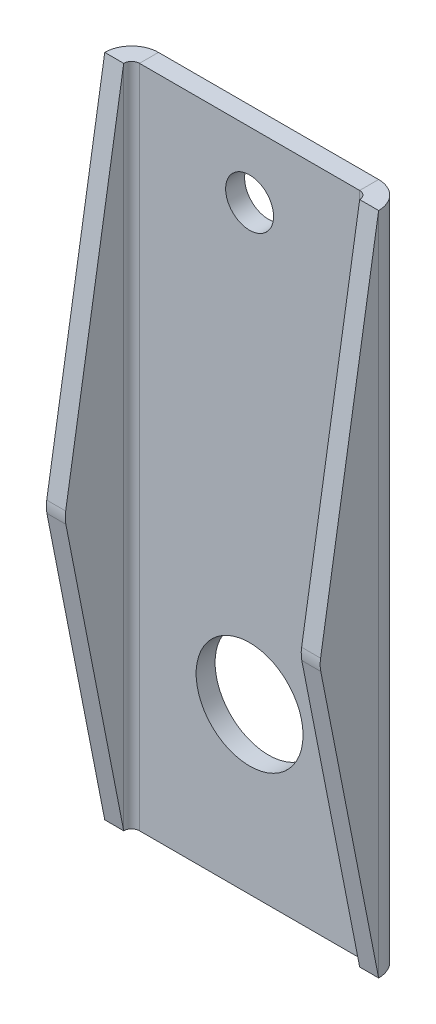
ISO-10303-21;
HEADER;
FILE_DESCRIPTION(('STEP AP214'),'2;1');
FILE_NAME('part.step','',(''),(''),'','','');
FILE_SCHEMA(('AUTOMOTIVE_DESIGN { 1 0 10303 214 1 1 1 1 }'));
ENDSEC;
DATA;
#1=APPLICATION_CONTEXT('core data for automotive mechanical design processes');
#2=APPLICATION_PROTOCOL_DEFINITION('international standard','automotive_design',2000,#1);
#3=PRODUCT_CONTEXT('',#1,'mechanical');
#4=PRODUCT('Part','Part','',(#3));
#5=PRODUCT_RELATED_PRODUCT_CATEGORY('part','',(#4));
#6=PRODUCT_DEFINITION_FORMATION('','',#4);
#7=PRODUCT_DEFINITION_CONTEXT('part definition',#1,'design');
#8=PRODUCT_DEFINITION('design','',#6,#7);
#9=PRODUCT_DEFINITION_SHAPE('','',#8);
#10=(LENGTH_UNIT() NAMED_UNIT(*) SI_UNIT(.MILLI.,.METRE.));
#11=(NAMED_UNIT(*) PLANE_ANGLE_UNIT() SI_UNIT($,.RADIAN.));
#12=(NAMED_UNIT(*) SI_UNIT($,.STERADIAN.) SOLID_ANGLE_UNIT());
#13=UNCERTAINTY_MEASURE_WITH_UNIT(LENGTH_MEASURE(1.E-05),#10,'distance_accuracy_value','');
#14=(GEOMETRIC_REPRESENTATION_CONTEXT(3) GLOBAL_UNCERTAINTY_ASSIGNED_CONTEXT((#13)) GLOBAL_UNIT_ASSIGNED_CONTEXT((#10,
#11,#12)) REPRESENTATION_CONTEXT('',''));
#15=CARTESIAN_POINT('',(0.,0.,0.));
#16=DIRECTION('',(0.,0.,1.));
#17=DIRECTION('',(1.,0.,0.));
#18=AXIS2_PLACEMENT_3D('',#15,#16,#17);
#19=CARTESIAN_POINT('',(-6.60400000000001,0.,0.));
#20=DIRECTION('',(1.,0.,0.));
#21=DIRECTION('',(0.,0.,-1.));
#22=AXIS2_PLACEMENT_3D('',#19,#20,#21);
#23=PLANE('',#22);
#24=DIRECTION('',(0.,0.981237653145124,0.192802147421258));
#25=VECTOR('',#24,1.);
#26=CARTESIAN_POINT('',(-6.60400000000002,-0.667860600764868,3.39897650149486));
#27=LINE('',#26,#25);
#28=CARTESIAN_POINT('',(-6.604,-16.0274,0.380999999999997));
#29=VERTEX_POINT('',#28);
#30=CARTESIAN_POINT('',(-6.60400000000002,-1.83007340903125,3.17061477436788));
#31=VERTEX_POINT('',#30);
#32=EDGE_CURVE('E181',#29,#31,#27,.T.);
#33=ORIENTED_EDGE('',*,*,#32,.T.);
#34=CARTESIAN_POINT('',(-6.60400000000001,-1.52400000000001,1.61289999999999));
#35=DIRECTION('',(1.,0.,0.));
#36=DIRECTION('',(0.,0.,-1.));
#37=AXIS2_PLACEMENT_3D('',#34,#35,#36);
#38=CIRCLE('',#37,1.5875);
#39=CARTESIAN_POINT('',(-6.60400000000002,-1.27041984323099,3.18001625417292));
#40=VERTEX_POINT('',#39);
#41=EDGE_CURVE('E168',#31,#40,#38,.F.);
#42=ORIENTED_EDGE('',*,*,#41,.T.);
#43=DIRECTION('',(0.,0.987159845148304,-0.159735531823));
#44=VECTOR('',#43,1.);
#45=CARTESIAN_POINT('',(-6.60400000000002,0.469023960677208,2.89855121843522));
#46=LINE('',#45,#44);
#47=CARTESIAN_POINT('',(-6.60400000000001,16.0274,0.38099999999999));
#48=VERTEX_POINT('',#47);
#49=EDGE_CURVE('E176',#40,#48,#46,.T.);
#50=ORIENTED_EDGE('',*,*,#49,.T.);
#51=DIRECTION('',(0.,-1.,0.));
#52=VECTOR('',#51,1.);
#53=CARTESIAN_POINT('',(-6.60400000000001,16.0274,0.380999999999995));
#54=LINE('',#53,#52);
#55=EDGE_CURVE('E188',#29,#48,#54,.F.);
#56=ORIENTED_EDGE('',*,*,#55,.F.);
#57=EDGE_LOOP('',(#33,#42,#50,#56));
#58=FACE_BOUND('',#57,.T.);
#59=ADVANCED_FACE('F77',(#58),#23,.F.);
#60=CARTESIAN_POINT('',(-5.68960000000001,0.,0.));
#61=DIRECTION('',(1.,0.,0.));
#62=DIRECTION('',(0.,0.,-1.));
#63=AXIS2_PLACEMENT_3D('',#60,#61,#62);
#64=PLANE('',#63);
#65=CARTESIAN_POINT('',(-5.68960000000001,-1.52400000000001,1.6129));
#66=DIRECTION('',(1.,0.,0.));
#67=DIRECTION('',(0.,0.,-1.));
#68=AXIS2_PLACEMENT_3D('',#65,#66,#67);
#69=CIRCLE('',#68,1.5875);
#70=CARTESIAN_POINT('',(-5.68960000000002,-1.83007340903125,3.17061477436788));
#71=VERTEX_POINT('',#70);
#72=CARTESIAN_POINT('',(-5.68960000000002,-1.27041984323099,3.18001625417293));
#73=VERTEX_POINT('',#72);
#74=EDGE_CURVE('E194',#71,#73,#69,.F.);
#75=ORIENTED_EDGE('',*,*,#74,.F.);
#76=DIRECTION('',(0.,0.981237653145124,0.192802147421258));
#77=VECTOR('',#76,1.);
#78=CARTESIAN_POINT('',(-5.68960000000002,-0.667860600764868,3.39897650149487));
#79=LINE('',#78,#77);
#80=CARTESIAN_POINT('',(-5.68960000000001,-16.0274,0.381));
#81=VERTEX_POINT('',#80);
#82=EDGE_CURVE('E177',#81,#71,#79,.T.);
#83=ORIENTED_EDGE('',*,*,#82,.F.);
#84=DIRECTION('',(0.,-1.,0.));
#85=VECTOR('',#84,1.);
#86=CARTESIAN_POINT('',(-5.68960000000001,16.0274,0.380999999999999));
#87=LINE('',#86,#85);
#88=CARTESIAN_POINT('',(-5.68960000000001,16.0274,0.380999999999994));
#89=VERTEX_POINT('',#88);
#90=EDGE_CURVE('E258',#89,#81,#87,.T.);
#91=ORIENTED_EDGE('',*,*,#90,.F.);
#92=DIRECTION('',(0.,0.987159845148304,-0.159735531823));
#93=VECTOR('',#92,1.);
#94=CARTESIAN_POINT('',(-5.68960000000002,0.469023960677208,2.89855121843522));
#95=LINE('',#94,#93);
#96=EDGE_CURVE('E196',#73,#89,#95,.T.);
#97=ORIENTED_EDGE('',*,*,#96,.F.);
#98=EDGE_LOOP('',(#75,#83,#91,#97));
#99=FACE_BOUND('',#98,.T.);
#100=ADVANCED_FACE('F334',(#99),#64,.T.);
#101=CARTESIAN_POINT('',(6.60399999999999,0.,0.));
#102=DIRECTION('',(-1.,0.,0.));
#103=DIRECTION('',(0.,0.,1.));
#104=AXIS2_PLACEMENT_3D('',#101,#102,#103);
#105=PLANE('',#104);
#106=DIRECTION('',(0.,-0.987159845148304,0.159735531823));
#107=VECTOR('',#106,1.);
#108=CARTESIAN_POINT('',(6.604,0.46902396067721,2.89855121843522));
#109=LINE('',#108,#107);
#110=CARTESIAN_POINT('',(6.60399999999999,16.0274,0.38099999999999));
#111=VERTEX_POINT('',#110);
#112=CARTESIAN_POINT('',(6.60400000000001,-1.27041984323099,3.18001625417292));
#113=VERTEX_POINT('',#112);
#114=EDGE_CURVE('E205',#111,#113,#109,.T.);
#115=ORIENTED_EDGE('',*,*,#114,.T.);
#116=CARTESIAN_POINT('',(6.604,-1.52400000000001,1.61289999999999));
#117=DIRECTION('',(-1.,0.,0.));
#118=DIRECTION('',(0.,0.,1.));
#119=AXIS2_PLACEMENT_3D('',#116,#117,#118);
#120=CIRCLE('',#119,1.5875);
#121=CARTESIAN_POINT('',(6.60400000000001,-1.83007340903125,3.17061477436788));
#122=VERTEX_POINT('',#121);
#123=EDGE_CURVE('E200',#113,#122,#120,.F.);
#124=ORIENTED_EDGE('',*,*,#123,.T.);
#125=DIRECTION('',(0.,-0.981237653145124,-0.192802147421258));
#126=VECTOR('',#125,1.);
#127=CARTESIAN_POINT('',(6.60400000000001,-0.667860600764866,3.39897650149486));
#128=LINE('',#127,#126);
#129=CARTESIAN_POINT('',(6.604,-16.0274,0.380999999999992));
#130=VERTEX_POINT('',#129);
#131=EDGE_CURVE('E203',#122,#130,#128,.T.);
#132=ORIENTED_EDGE('',*,*,#131,.T.);
#133=DIRECTION('',(0.,1.,0.));
#134=VECTOR('',#133,1.);
#135=CARTESIAN_POINT('',(6.604,-16.0274,0.380999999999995));
#136=LINE('',#135,#134);
#137=EDGE_CURVE('E219',#111,#130,#136,.F.);
#138=ORIENTED_EDGE('',*,*,#137,.F.);
#139=EDGE_LOOP('',(#115,#124,#132,#138));
#140=FACE_BOUND('',#139,.T.);
#141=ADVANCED_FACE('F307',(#140),#105,.F.);
#142=CARTESIAN_POINT('',(5.68959999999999,0.,0.));
#143=DIRECTION('',(-1.,0.,0.));
#144=DIRECTION('',(0.,0.,1.));
#145=AXIS2_PLACEMENT_3D('',#142,#143,#144);
#146=PLANE('',#145);
#147=CARTESIAN_POINT('',(5.6896,-1.52400000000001,1.6129));
#148=DIRECTION('',(-1.,0.,0.));
#149=DIRECTION('',(0.,0.,1.));
#150=AXIS2_PLACEMENT_3D('',#147,#148,#149);
#151=CIRCLE('',#150,1.5875);
#152=CARTESIAN_POINT('',(5.68960000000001,-1.27041984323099,3.18001625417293));
#153=VERTEX_POINT('',#152);
#154=CARTESIAN_POINT('',(5.68960000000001,-1.83007340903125,3.17061477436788));
#155=VERTEX_POINT('',#154);
#156=EDGE_CURVE('E184',#153,#155,#151,.F.);
#157=ORIENTED_EDGE('',*,*,#156,.F.);
#158=DIRECTION('',(0.,-0.987159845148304,0.159735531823));
#159=VECTOR('',#158,1.);
#160=CARTESIAN_POINT('',(5.6896,0.46902396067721,2.89855121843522));
#161=LINE('',#160,#159);
#162=CARTESIAN_POINT('',(5.6896,16.0274,0.380999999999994));
#163=VERTEX_POINT('',#162);
#164=EDGE_CURVE('E204',#163,#153,#161,.T.);
#165=ORIENTED_EDGE('',*,*,#164,.F.);
#166=DIRECTION('',(0.,1.,0.));
#167=VECTOR('',#166,1.);
#168=CARTESIAN_POINT('',(5.6896,-16.0274,0.380999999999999));
#169=LINE('',#168,#167);
#170=CARTESIAN_POINT('',(5.6896,-16.0274,0.380999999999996));
#171=VERTEX_POINT('',#170);
#172=EDGE_CURVE('E226',#171,#163,#169,.T.);
#173=ORIENTED_EDGE('',*,*,#172,.F.);
#174=DIRECTION('',(0.,-0.981237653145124,-0.192802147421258));
#175=VECTOR('',#174,1.);
#176=CARTESIAN_POINT('',(5.68960000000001,-0.667860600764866,3.39897650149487));
#177=LINE('',#176,#175);
#178=EDGE_CURVE('E211',#155,#171,#177,.T.);
#179=ORIENTED_EDGE('',*,*,#178,.F.);
#180=EDGE_LOOP('',(#157,#165,#173,#179));
#181=FACE_BOUND('',#180,.T.);
#182=ADVANCED_FACE('F321',(#181),#146,.T.);
#183=CARTESIAN_POINT('',(0.,0.,-0.9144));
#184=DIRECTION('',(0.,0.,1.));
#185=DIRECTION('',(1.,0.,0.));
#186=AXIS2_PLACEMENT_3D('',#183,#184,#185);
#187=PLANE('',#186);
#188=CARTESIAN_POINT('',(0.,12.8651,-0.914400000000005));
#189=DIRECTION('',(0.,0.,1.));
#190=DIRECTION('',(1.,0.,0.));
#191=AXIS2_PLACEMENT_3D('',#188,#189,#190);
#192=CIRCLE('',#191,1.1557);
#193=CARTESIAN_POINT('',(1.1557,12.8651,-0.914400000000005));
#194=VERTEX_POINT('',#193);
#195=EDGE_CURVE('E401',#194,#194,#192,.T.);
#196=ORIENTED_EDGE('',*,*,#195,.T.);
#197=EDGE_LOOP('',(#196));
#198=FACE_BOUND('',#197,.T.);
#199=CARTESIAN_POINT('',(0.,-8.0899,-0.914400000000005));
#200=DIRECTION('',(0.,0.,1.));
#201=DIRECTION('',(1.,0.,0.));
#202=AXIS2_PLACEMENT_3D('',#199,#200,#201);
#203=CIRCLE('',#202,2.5781);
#204=CARTESIAN_POINT('',(2.5781,-8.0899,-0.914400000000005));
#205=VERTEX_POINT('',#204);
#206=EDGE_CURVE('E197',#205,#205,#203,.T.);
#207=ORIENTED_EDGE('',*,*,#206,.T.);
#208=EDGE_LOOP('',(#207));
#209=FACE_BOUND('',#208,.T.);
#210=DIRECTION('',(0.,1.,0.));
#211=VECTOR('',#210,1.);
#212=CARTESIAN_POINT('',(5.30859999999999,16.0274,-0.914400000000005));
#213=LINE('',#212,#211);
#214=CARTESIAN_POINT('',(5.30859999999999,16.0274,-0.914400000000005));
#215=VERTEX_POINT('',#214);
#216=CARTESIAN_POINT('',(5.30859999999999,-16.0274,-0.9144));
#217=VERTEX_POINT('',#216);
#218=EDGE_CURVE('E230',#215,#217,#213,.F.);
#219=ORIENTED_EDGE('',*,*,#218,.T.);
#220=DIRECTION('',(1.,0.,0.));
#221=VECTOR('',#220,1.);
#222=CARTESIAN_POINT('',(-6.604,-16.0274,-0.9144));
#223=LINE('',#222,#221);
#224=CARTESIAN_POINT('',(-5.3086,-16.0274,-0.914400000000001));
#225=VERTEX_POINT('',#224);
#226=EDGE_CURVE('E13',#225,#217,#223,.T.);
#227=ORIENTED_EDGE('',*,*,#226,.F.);
#228=DIRECTION('',(0.,-1.,0.));
#229=VECTOR('',#228,1.);
#230=CARTESIAN_POINT('',(-5.3086,-16.0274,-0.914400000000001));
#231=LINE('',#230,#229);
#232=CARTESIAN_POINT('',(-5.30860000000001,16.0274,-0.9144));
#233=VERTEX_POINT('',#232);
#234=EDGE_CURVE('E262',#225,#233,#231,.F.);
#235=ORIENTED_EDGE('',*,*,#234,.T.);
#236=DIRECTION('',(-1.,0.,0.));
#237=VECTOR('',#236,1.);
#238=CARTESIAN_POINT('',(-6.60400000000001,16.0274,-0.9144));
#239=LINE('',#238,#237);
#240=EDGE_CURVE('E86',#215,#233,#239,.T.);
#241=ORIENTED_EDGE('',*,*,#240,.F.);
#242=EDGE_LOOP('',(#219,#227,#235,#241));
#243=FACE_BOUND('',#242,.T.);
#244=ADVANCED_FACE('F361',(#198,#209,#243),#187,.F.);
#245=CARTESIAN_POINT('',(0.,0.,0.));
#246=DIRECTION('',(0.,0.,1.));
#247=DIRECTION('',(1.,0.,0.));
#248=AXIS2_PLACEMENT_3D('',#245,#246,#247);
#249=PLANE('',#248);
#250=CARTESIAN_POINT('',(0.,12.8651,0.));
#251=DIRECTION('',(0.,0.,1.));
#252=DIRECTION('',(1.,0.,0.));
#253=AXIS2_PLACEMENT_3D('',#250,#251,#252);
#254=CIRCLE('',#253,1.1557);
#255=CARTESIAN_POINT('',(1.1557,12.8651,0.));
#256=VERTEX_POINT('',#255);
#257=EDGE_CURVE('E404',#256,#256,#254,.T.);
#258=ORIENTED_EDGE('',*,*,#257,.F.);
#259=EDGE_LOOP('',(#258));
#260=FACE_BOUND('',#259,.T.);
#261=CARTESIAN_POINT('',(0.,-8.0899,0.));
#262=DIRECTION('',(0.,0.,1.));
#263=DIRECTION('',(1.,0.,0.));
#264=AXIS2_PLACEMENT_3D('',#261,#262,#263);
#265=CIRCLE('',#264,2.5781);
#266=CARTESIAN_POINT('',(2.5781,-8.0899,0.));
#267=VERTEX_POINT('',#266);
#268=EDGE_CURVE('E406',#267,#267,#265,.T.);
#269=ORIENTED_EDGE('',*,*,#268,.F.);
#270=EDGE_LOOP('',(#269));
#271=FACE_BOUND('',#270,.T.);
#272=DIRECTION('',(1.,0.,0.));
#273=VECTOR('',#272,1.);
#274=CARTESIAN_POINT('',(-6.604,-16.0274,0.));
#275=LINE('',#274,#273);
#276=CARTESIAN_POINT('',(-5.30860000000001,-16.0274,0.));
#277=VERTEX_POINT('',#276);
#278=CARTESIAN_POINT('',(5.30859999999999,-16.0274,0.));
#279=VERTEX_POINT('',#278);
#280=EDGE_CURVE('E81',#277,#279,#275,.T.);
#281=ORIENTED_EDGE('',*,*,#280,.T.);
#282=DIRECTION('',(0.,1.,0.));
#283=VECTOR('',#282,1.);
#284=CARTESIAN_POINT('',(5.30859999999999,16.0274,0.));
#285=LINE('',#284,#283);
#286=CARTESIAN_POINT('',(5.30859999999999,16.0274,0.));
#287=VERTEX_POINT('',#286);
#288=EDGE_CURVE('E242',#287,#279,#285,.F.);
#289=ORIENTED_EDGE('',*,*,#288,.F.);
#290=DIRECTION('',(-1.,0.,0.));
#291=VECTOR('',#290,1.);
#292=CARTESIAN_POINT('',(-6.60400000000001,16.0274,0.));
#293=LINE('',#292,#291);
#294=CARTESIAN_POINT('',(-5.30860000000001,16.0274,0.));
#295=VERTEX_POINT('',#294);
#296=EDGE_CURVE('E283',#287,#295,#293,.T.);
#297=ORIENTED_EDGE('',*,*,#296,.T.);
#298=DIRECTION('',(0.,-1.,0.));
#299=VECTOR('',#298,1.);
#300=CARTESIAN_POINT('',(-5.30860000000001,-16.0274,0.));
#301=LINE('',#300,#299);
#302=EDGE_CURVE('E275',#277,#295,#301,.F.);
#303=ORIENTED_EDGE('',*,*,#302,.F.);
#304=EDGE_LOOP('',(#281,#289,#297,#303));
#305=FACE_BOUND('',#304,.T.);
#306=ADVANCED_FACE('F291',(#260,#271,#305),#249,.T.);
#307=CARTESIAN_POINT('',(-6.60400000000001,16.0274,-0.9144));
#308=DIRECTION('',(0.,1.,0.));
#309=DIRECTION('',(0.,0.,1.));
#310=AXIS2_PLACEMENT_3D('',#307,#308,#309);
#311=PLANE('',#310);
#312=ORIENTED_EDGE('',*,*,#296,.F.);
#313=DIRECTION('',(0.,0.,-1.));
#314=VECTOR('',#313,1.);
#315=CARTESIAN_POINT('',(5.30859999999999,16.0274,0.));
#316=LINE('',#315,#314);
#317=EDGE_CURVE('E236',#287,#215,#316,.T.);
#318=ORIENTED_EDGE('',*,*,#317,.T.);
#319=ORIENTED_EDGE('',*,*,#240,.T.);
#320=DIRECTION('',(0.,0.,-1.));
#321=VECTOR('',#320,1.);
#322=CARTESIAN_POINT('',(-5.30860000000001,16.0274,0.));
#323=LINE('',#322,#321);
#324=EDGE_CURVE('E280',#295,#233,#323,.T.);
#325=ORIENTED_EDGE('',*,*,#324,.F.);
#326=EDGE_LOOP('',(#312,#318,#319,#325));
#327=FACE_BOUND('',#326,.T.);
#328=ADVANCED_FACE('F79',(#327),#311,.T.);
#329=CARTESIAN_POINT('',(-6.604,-16.0274,-0.9144));
#330=DIRECTION('',(0.,-1.,0.));
#331=DIRECTION('',(0.,0.,-1.));
#332=AXIS2_PLACEMENT_3D('',#329,#330,#331);
#333=PLANE('',#332);
#334=DIRECTION('',(0.,0.,-1.));
#335=VECTOR('',#334,1.);
#336=CARTESIAN_POINT('',(5.30859999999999,-16.0274,0.));
#337=LINE('',#336,#335);
#338=EDGE_CURVE('E247',#279,#217,#337,.T.);
#339=ORIENTED_EDGE('',*,*,#338,.F.);
#340=ORIENTED_EDGE('',*,*,#280,.F.);
#341=DIRECTION('',(0.,0.,-1.));
#342=VECTOR('',#341,1.);
#343=CARTESIAN_POINT('',(-5.30860000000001,-16.0274,0.));
#344=LINE('',#343,#342);
#345=EDGE_CURVE('E269',#277,#225,#344,.T.);
#346=ORIENTED_EDGE('',*,*,#345,.T.);
#347=ORIENTED_EDGE('',*,*,#226,.T.);
#348=EDGE_LOOP('',(#339,#340,#346,#347));
#349=FACE_BOUND('',#348,.T.);
#350=ADVANCED_FACE('F356',(#349),#333,.T.);
#351=CARTESIAN_POINT('',(-5.30860000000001,16.0274,0.380999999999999));
#352=DIRECTION('',(0.,1.,0.));
#353=DIRECTION('',(0.,0.,1.));
#354=AXIS2_PLACEMENT_3D('',#351,#352,#353);
#355=PLANE('',#354);
#356=DIRECTION('',(1.,0.,0.));
#357=VECTOR('',#356,1.);
#358=CARTESIAN_POINT('',(-6.60400000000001,16.0274,0.380999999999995));
#359=LINE('',#358,#357);
#360=EDGE_CURVE('E250',#89,#48,#359,.F.);
#361=ORIENTED_EDGE('',*,*,#360,.F.);
#362=CARTESIAN_POINT('',(-5.30860000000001,16.0274,0.380999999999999));
#363=DIRECTION('',(0.,-1.,0.));
#364=DIRECTION('',(0.,0.,-1.));
#365=AXIS2_PLACEMENT_3D('',#362,#363,#364);
#366=CIRCLE('',#365,0.381000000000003);
#367=EDGE_CURVE('E272',#295,#89,#366,.F.);
#368=ORIENTED_EDGE('',*,*,#367,.F.);
#369=ORIENTED_EDGE('',*,*,#324,.T.);
#370=CARTESIAN_POINT('',(-5.30860000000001,16.0274,0.380999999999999));
#371=DIRECTION('',(0.,-1.,0.));
#372=DIRECTION('',(0.,0.,-1.));
#373=AXIS2_PLACEMENT_3D('',#370,#371,#372);
#374=CIRCLE('',#373,1.2954);
#375=EDGE_CURVE('E265',#233,#48,#374,.F.);
#376=ORIENTED_EDGE('',*,*,#375,.T.);
#377=EDGE_LOOP('',(#361,#368,#369,#376));
#378=FACE_BOUND('',#377,.T.);
#379=ADVANCED_FACE('F353',(#378),#355,.T.);
#380=CARTESIAN_POINT('',(-5.30860000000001,-16.0274,0.381000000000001));
#381=DIRECTION('',(0.,1.,0.));
#382=DIRECTION('',(0.,0.,1.));
#383=AXIS2_PLACEMENT_3D('',#380,#381,#382);
#384=PLANE('',#383);
#385=CARTESIAN_POINT('',(-5.30860000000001,-16.0274,0.381000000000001));
#386=DIRECTION('',(0.,-1.,0.));
#387=DIRECTION('',(0.,0.,-1.));
#388=AXIS2_PLACEMENT_3D('',#385,#386,#387);
#389=CIRCLE('',#388,0.381000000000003);
#390=EDGE_CURVE('E254',#81,#277,#389,.T.);
#391=ORIENTED_EDGE('',*,*,#390,.F.);
#392=DIRECTION('',(1.,0.,0.));
#393=VECTOR('',#392,1.);
#394=CARTESIAN_POINT('',(-5.6896,-16.0274,0.380999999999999));
#395=LINE('',#394,#393);
#396=EDGE_CURVE('E255',#81,#29,#395,.F.);
#397=ORIENTED_EDGE('',*,*,#396,.T.);
#398=CARTESIAN_POINT('',(-5.30860000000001,-16.0274,0.381000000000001));
#399=DIRECTION('',(0.,-1.,0.));
#400=DIRECTION('',(0.,0.,-1.));
#401=AXIS2_PLACEMENT_3D('',#398,#399,#400);
#402=CIRCLE('',#401,1.2954);
#403=EDGE_CURVE('E266',#29,#225,#402,.T.);
#404=ORIENTED_EDGE('',*,*,#403,.T.);
#405=ORIENTED_EDGE('',*,*,#345,.F.);
#406=EDGE_LOOP('',(#391,#397,#404,#405));
#407=FACE_BOUND('',#406,.T.);
#408=ADVANCED_FACE('F348',(#407),#384,.F.);
#409=CARTESIAN_POINT('',(-5.30860000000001,-16.0274,0.381000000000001));
#410=DIRECTION('',(0.,-1.,0.));
#411=DIRECTION('',(-1.,0.,0.));
#412=AXIS2_PLACEMENT_3D('',#409,#410,#411);
#413=CYLINDRICAL_SURFACE('',#412,1.2954);
#414=ORIENTED_EDGE('',*,*,#234,.F.);
#415=ORIENTED_EDGE('',*,*,#403,.F.);
#416=ORIENTED_EDGE('',*,*,#55,.T.);
#417=ORIENTED_EDGE('',*,*,#375,.F.);
#418=EDGE_LOOP('',(#414,#415,#416,#417));
#419=FACE_BOUND('',#418,.T.);
#420=ADVANCED_FACE('F344',(#419),#413,.T.);
#421=CARTESIAN_POINT('',(-5.30860000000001,-16.0274,0.381000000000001));
#422=DIRECTION('',(0.,-1.,0.));
#423=DIRECTION('',(-1.,0.,0.));
#424=AXIS2_PLACEMENT_3D('',#421,#422,#423);
#425=CYLINDRICAL_SURFACE('',#424,0.381000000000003);
#426=ORIENTED_EDGE('',*,*,#302,.T.);
#427=ORIENTED_EDGE('',*,*,#367,.T.);
#428=ORIENTED_EDGE('',*,*,#90,.T.);
#429=ORIENTED_EDGE('',*,*,#390,.T.);
#430=EDGE_LOOP('',(#426,#427,#428,#429));
#431=FACE_BOUND('',#430,.T.);
#432=ADVANCED_FACE('F347',(#431),#425,.F.);
#433=CARTESIAN_POINT('',(5.30859999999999,-16.0274,0.381));
#434=DIRECTION('',(0.,-1.,0.));
#435=DIRECTION('',(0.,0.,-1.));
#436=AXIS2_PLACEMENT_3D('',#433,#434,#435);
#437=PLANE('',#436);
#438=DIRECTION('',(-1.,0.,0.));
#439=VECTOR('',#438,1.);
#440=CARTESIAN_POINT('',(6.604,-16.0274,0.380999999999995));
#441=LINE('',#440,#439);
#442=EDGE_CURVE('E217',#171,#130,#441,.F.);
#443=ORIENTED_EDGE('',*,*,#442,.F.);
#444=CARTESIAN_POINT('',(5.30859999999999,-16.0274,0.381));
#445=DIRECTION('',(0.,1.,0.));
#446=DIRECTION('',(0.,0.,1.));
#447=AXIS2_PLACEMENT_3D('',#444,#445,#446);
#448=CIRCLE('',#447,0.381000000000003);
#449=EDGE_CURVE('E239',#279,#171,#448,.F.);
#450=ORIENTED_EDGE('',*,*,#449,.F.);
#451=ORIENTED_EDGE('',*,*,#338,.T.);
#452=CARTESIAN_POINT('',(5.30859999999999,-16.0274,0.381));
#453=DIRECTION('',(0.,1.,0.));
#454=DIRECTION('',(0.,0.,1.));
#455=AXIS2_PLACEMENT_3D('',#452,#453,#454);
#456=CIRCLE('',#455,1.2954);
#457=EDGE_CURVE('E232',#217,#130,#456,.F.);
#458=ORIENTED_EDGE('',*,*,#457,.T.);
#459=EDGE_LOOP('',(#443,#450,#451,#458));
#460=FACE_BOUND('',#459,.T.);
#461=ADVANCED_FACE('F301',(#460),#437,.T.);
#462=CARTESIAN_POINT('',(5.30859999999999,16.0274,0.380999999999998));
#463=DIRECTION('',(0.,-1.,0.));
#464=DIRECTION('',(0.,0.,-1.));
#465=AXIS2_PLACEMENT_3D('',#462,#463,#464);
#466=PLANE('',#465);
#467=CARTESIAN_POINT('',(5.30859999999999,16.0274,0.380999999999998));
#468=DIRECTION('',(0.,1.,0.));
#469=DIRECTION('',(0.,0.,1.));
#470=AXIS2_PLACEMENT_3D('',#467,#468,#469);
#471=CIRCLE('',#470,0.381000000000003);
#472=EDGE_CURVE('E222',#163,#287,#471,.T.);
#473=ORIENTED_EDGE('',*,*,#472,.F.);
#474=DIRECTION('',(-1.,0.,0.));
#475=VECTOR('',#474,1.);
#476=CARTESIAN_POINT('',(5.68959999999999,16.0274,0.380999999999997));
#477=LINE('',#476,#475);
#478=EDGE_CURVE('E223',#163,#111,#477,.F.);
#479=ORIENTED_EDGE('',*,*,#478,.T.);
#480=CARTESIAN_POINT('',(5.30859999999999,16.0274,0.380999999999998));
#481=DIRECTION('',(0.,1.,0.));
#482=DIRECTION('',(0.,0.,1.));
#483=AXIS2_PLACEMENT_3D('',#480,#481,#482);
#484=CIRCLE('',#483,1.2954);
#485=EDGE_CURVE('E233',#111,#215,#484,.T.);
#486=ORIENTED_EDGE('',*,*,#485,.T.);
#487=ORIENTED_EDGE('',*,*,#317,.F.);
#488=EDGE_LOOP('',(#473,#479,#486,#487));
#489=FACE_BOUND('',#488,.T.);
#490=ADVANCED_FACE('F314',(#489),#466,.F.);
#491=CARTESIAN_POINT('',(5.30859999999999,16.0274,0.380999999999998));
#492=DIRECTION('',(0.,1.,0.));
#493=DIRECTION('',(1.,0.,0.));
#494=AXIS2_PLACEMENT_3D('',#491,#492,#493);
#495=CYLINDRICAL_SURFACE('',#494,1.2954);
#496=ORIENTED_EDGE('',*,*,#218,.F.);
#497=ORIENTED_EDGE('',*,*,#485,.F.);
#498=ORIENTED_EDGE('',*,*,#137,.T.);
#499=ORIENTED_EDGE('',*,*,#457,.F.);
#500=EDGE_LOOP('',(#496,#497,#498,#499));
#501=FACE_BOUND('',#500,.T.);
#502=ADVANCED_FACE('F311',(#501),#495,.T.);
#503=CARTESIAN_POINT('',(5.30859999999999,16.0274,0.380999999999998));
#504=DIRECTION('',(0.,1.,0.));
#505=DIRECTION('',(1.,0.,0.));
#506=AXIS2_PLACEMENT_3D('',#503,#504,#505);
#507=CYLINDRICAL_SURFACE('',#506,0.381000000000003);
#508=ORIENTED_EDGE('',*,*,#288,.T.);
#509=ORIENTED_EDGE('',*,*,#449,.T.);
#510=ORIENTED_EDGE('',*,*,#172,.T.);
#511=ORIENTED_EDGE('',*,*,#472,.T.);
#512=EDGE_LOOP('',(#508,#509,#510,#511));
#513=FACE_BOUND('',#512,.T.);
#514=ADVANCED_FACE('F296',(#513),#507,.F.);
#515=CARTESIAN_POINT('',(5.6896,0.46902396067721,2.89855121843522));
#516=DIRECTION('',(0.,-0.159735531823,-0.987159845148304));
#517=DIRECTION('',(0.,-0.987159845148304,0.159735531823));
#518=AXIS2_PLACEMENT_3D('',#515,#516,#517);
#519=PLANE('',#518);
#520=ORIENTED_EDGE('',*,*,#478,.F.);
#521=ORIENTED_EDGE('',*,*,#164,.T.);
#522=DIRECTION('',(-1.,0.,0.));
#523=VECTOR('',#522,1.);
#524=CARTESIAN_POINT('',(5.68960000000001,-1.27041984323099,3.18001625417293));
#525=LINE('',#524,#523);
#526=EDGE_CURVE('E214',#153,#113,#525,.F.);
#527=ORIENTED_EDGE('',*,*,#526,.T.);
#528=ORIENTED_EDGE('',*,*,#114,.F.);
#529=EDGE_LOOP('',(#520,#521,#527,#528));
#530=FACE_BOUND('',#529,.T.);
#531=ADVANCED_FACE('F317',(#530),#519,.F.);
#532=CARTESIAN_POINT('',(5.6896,-1.52400000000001,1.6129));
#533=DIRECTION('',(-1.,0.,0.));
#534=DIRECTION('',(0.,0.,1.));
#535=AXIS2_PLACEMENT_3D('',#532,#533,#534);
#536=CYLINDRICAL_SURFACE('',#535,1.5875);
#537=ORIENTED_EDGE('',*,*,#526,.F.);
#538=ORIENTED_EDGE('',*,*,#156,.T.);
#539=DIRECTION('',(-1.,0.,0.));
#540=VECTOR('',#539,1.);
#541=CARTESIAN_POINT('',(5.68960000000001,-1.83007340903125,3.17061477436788));
#542=LINE('',#541,#540);
#543=EDGE_CURVE('E102',#155,#122,#542,.F.);
#544=ORIENTED_EDGE('',*,*,#543,.T.);
#545=ORIENTED_EDGE('',*,*,#123,.F.);
#546=EDGE_LOOP('',(#537,#538,#544,#545));
#547=FACE_BOUND('',#546,.T.);
#548=ADVANCED_FACE('F323',(#547),#536,.T.);
#549=CARTESIAN_POINT('',(5.68960000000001,-0.667860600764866,3.39897650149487));
#550=DIRECTION('',(0.,0.192802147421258,-0.981237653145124));
#551=DIRECTION('',(0.,-0.981237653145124,-0.192802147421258));
#552=AXIS2_PLACEMENT_3D('',#549,#550,#551);
#553=PLANE('',#552);
#554=ORIENTED_EDGE('',*,*,#178,.T.);
#555=ORIENTED_EDGE('',*,*,#442,.T.);
#556=ORIENTED_EDGE('',*,*,#131,.F.);
#557=ORIENTED_EDGE('',*,*,#543,.F.);
#558=EDGE_LOOP('',(#554,#555,#556,#557));
#559=FACE_BOUND('',#558,.T.);
#560=ADVANCED_FACE('F303',(#559),#553,.F.);
#561=CARTESIAN_POINT('',(-5.68960000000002,-0.667860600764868,3.39897650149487));
#562=DIRECTION('',(0.,0.192802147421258,-0.981237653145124));
#563=DIRECTION('',(0.,0.981237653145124,0.192802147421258));
#564=AXIS2_PLACEMENT_3D('',#561,#562,#563);
#565=PLANE('',#564);
#566=ORIENTED_EDGE('',*,*,#396,.F.);
#567=ORIENTED_EDGE('',*,*,#82,.T.);
#568=DIRECTION('',(1.,0.,0.));
#569=VECTOR('',#568,1.);
#570=CARTESIAN_POINT('',(-5.68960000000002,-1.83007340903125,3.17061477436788));
#571=LINE('',#570,#569);
#572=EDGE_CURVE('E171',#71,#31,#571,.F.);
#573=ORIENTED_EDGE('',*,*,#572,.T.);
#574=ORIENTED_EDGE('',*,*,#32,.F.);
#575=EDGE_LOOP('',(#566,#567,#573,#574));
#576=FACE_BOUND('',#575,.T.);
#577=ADVANCED_FACE('F180',(#576),#565,.F.);
#578=CARTESIAN_POINT('',(-5.68960000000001,-1.52400000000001,1.6129));
#579=DIRECTION('',(1.,0.,0.));
#580=DIRECTION('',(0.,0.,-1.));
#581=AXIS2_PLACEMENT_3D('',#578,#579,#580);
#582=CYLINDRICAL_SURFACE('',#581,1.5875);
#583=ORIENTED_EDGE('',*,*,#572,.F.);
#584=ORIENTED_EDGE('',*,*,#74,.T.);
#585=DIRECTION('',(1.,0.,0.));
#586=VECTOR('',#585,1.);
#587=CARTESIAN_POINT('',(-5.68960000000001,-1.27041984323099,3.18001625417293));
#588=LINE('',#587,#586);
#589=EDGE_CURVE('E94',#73,#40,#588,.F.);
#590=ORIENTED_EDGE('',*,*,#589,.T.);
#591=ORIENTED_EDGE('',*,*,#41,.F.);
#592=EDGE_LOOP('',(#583,#584,#590,#591));
#593=FACE_BOUND('',#592,.T.);
#594=ADVANCED_FACE('F170',(#593),#582,.T.);
#595=CARTESIAN_POINT('',(-5.68960000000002,0.469023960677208,2.89855121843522));
#596=DIRECTION('',(0.,-0.159735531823,-0.987159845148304));
#597=DIRECTION('',(0.,0.987159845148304,-0.159735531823));
#598=AXIS2_PLACEMENT_3D('',#595,#596,#597);
#599=PLANE('',#598);
#600=ORIENTED_EDGE('',*,*,#96,.T.);
#601=ORIENTED_EDGE('',*,*,#360,.T.);
#602=ORIENTED_EDGE('',*,*,#49,.F.);
#603=ORIENTED_EDGE('',*,*,#589,.F.);
#604=EDGE_LOOP('',(#600,#601,#602,#603));
#605=FACE_BOUND('',#604,.T.);
#606=ADVANCED_FACE('F379',(#605),#599,.F.);
#607=CARTESIAN_POINT('',(0.,-8.0899,-0.914400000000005));
#608=DIRECTION('',(0.,0.,1.));
#609=DIRECTION('',(1.,0.,0.));
#610=AXIS2_PLACEMENT_3D('',#607,#608,#609);
#611=CYLINDRICAL_SURFACE('',#610,2.5781);
#612=ORIENTED_EDGE('',*,*,#206,.F.);
#613=EDGE_LOOP('',(#612));
#614=FACE_BOUND('',#613,.T.);
#615=ORIENTED_EDGE('',*,*,#268,.T.);
#616=EDGE_LOOP('',(#615));
#617=FACE_BOUND('',#616,.T.);
#618=ADVANCED_FACE('F382',(#614,#617),#611,.F.);
#619=CARTESIAN_POINT('',(0.,12.8651,-0.914400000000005));
#620=DIRECTION('',(0.,0.,1.));
#621=DIRECTION('',(1.,0.,0.));
#622=AXIS2_PLACEMENT_3D('',#619,#620,#621);
#623=CYLINDRICAL_SURFACE('',#622,1.1557);
#624=ORIENTED_EDGE('',*,*,#195,.F.);
#625=EDGE_LOOP('',(#624));
#626=FACE_BOUND('',#625,.T.);
#627=ORIENTED_EDGE('',*,*,#257,.T.);
#628=EDGE_LOOP('',(#627));
#629=FACE_BOUND('',#628,.T.);
#630=ADVANCED_FACE('F387',(#626,#629),#623,.F.);
#631=CLOSED_SHELL('',(#59,#100,#141,#182,#244,#306,#328,#350,#379,#408,#420,#432,#461,#490,#502,
#514,#531,#548,#560,#577,#594,#606,#618,#630));
#632=MANIFOLD_SOLID_BREP('B2',#631);
#633=ADVANCED_BREP_SHAPE_REPRESENTATION('',(#18,#632),#14);
#634=SHAPE_DEFINITION_REPRESENTATION(#9,#633);
ENDSEC;
END-ISO-10303-21;
